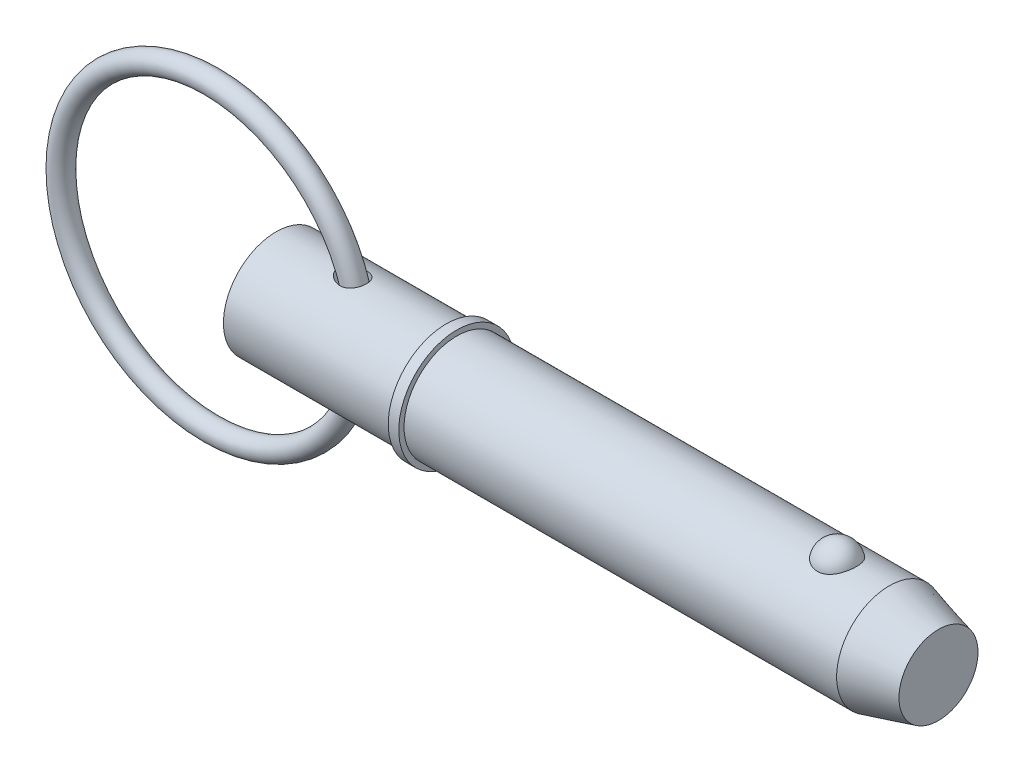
ISO-10303-21;
HEADER;
FILE_DESCRIPTION(('STEP AP214'),'2;1');
FILE_NAME('part.step','',(''),(''),'','','');
FILE_SCHEMA(('AUTOMOTIVE_DESIGN { 1 0 10303 214 1 1 1 1 }'));
ENDSEC;
DATA;
#1=APPLICATION_CONTEXT('core data for automotive mechanical design processes');
#2=APPLICATION_PROTOCOL_DEFINITION('international standard','automotive_design',2000,#1);
#3=PRODUCT_CONTEXT('',#1,'mechanical');
#4=PRODUCT('Part','Part','',(#3));
#5=PRODUCT_RELATED_PRODUCT_CATEGORY('part','',(#4));
#6=PRODUCT_DEFINITION_FORMATION('','',#4);
#7=PRODUCT_DEFINITION_CONTEXT('part definition',#1,'design');
#8=PRODUCT_DEFINITION('design','',#6,#7);
#9=PRODUCT_DEFINITION_SHAPE('','',#8);
#10=(LENGTH_UNIT() NAMED_UNIT(*) SI_UNIT(.MILLI.,.METRE.));
#11=(NAMED_UNIT(*) PLANE_ANGLE_UNIT() SI_UNIT($,.RADIAN.));
#12=(NAMED_UNIT(*) SI_UNIT($,.STERADIAN.) SOLID_ANGLE_UNIT());
#13=UNCERTAINTY_MEASURE_WITH_UNIT(LENGTH_MEASURE(1.E-05),#10,'distance_accuracy_value','');
#14=(GEOMETRIC_REPRESENTATION_CONTEXT(3) GLOBAL_UNCERTAINTY_ASSIGNED_CONTEXT((#13)) GLOBAL_UNIT_ASSIGNED_CONTEXT((#10,
#11,#12)) REPRESENTATION_CONTEXT('',''));
#15=CARTESIAN_POINT('',(0.,0.,0.));
#16=DIRECTION('',(0.,0.,1.));
#17=DIRECTION('',(1.,0.,0.));
#18=AXIS2_PLACEMENT_3D('',#15,#16,#17);
#19=CARTESIAN_POINT('',(-13.640845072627,0.,0.));
#20=DIRECTION('',(0.,0.,1.));
#21=DIRECTION('',(1.,0.,0.));
#22=AXIS2_PLACEMENT_3D('',#19,#20,#21);
#23=TOROIDAL_SURFACE('',#22,31.75,2.223);
#24=CARTESIAN_POINT('',(20.332154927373,0.,0.));
#25=VERTEX_POINT('',#24);
#26=VERTEX_LOOP('',#25);
#27=FACE_BOUND('',#26,.T.);
#28=ADVANCED_FACE('P0_F12',(#27),#23,.T.);
#29=CLOSED_SHELL('',(#28));
#30=MANIFOLD_SOLID_BREP('P0_B1',#29);
#31=CARTESIAN_POINT('',(0.,0.,0.));
#32=DIRECTION('',(1.,0.,0.));
#33=DIRECTION('',(0.,0.,-1.));
#34=AXIS2_PLACEMENT_3D('',#31,#32,#33);
#35=CYLINDRICAL_SURFACE('',#34,11.115);
#36=CARTESIAN_POINT('',(13.5245830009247,11.0328953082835,-1.34849772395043));
#37=CARTESIAN_POINT('',(13.6190616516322,11.0150940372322,-1.49413162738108));
#38=CARTESIAN_POINT('',(13.7272589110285,10.9954577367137,-1.63076546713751));
#39=CARTESIAN_POINT('',(13.9654537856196,10.9550099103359,-1.8834727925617));
#40=CARTESIAN_POINT('',(14.0954990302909,10.9341958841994,-1.99950019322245));
#41=CARTESIAN_POINT('',(14.3718600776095,10.893854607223,-2.20871939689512));
#42=CARTESIAN_POINT('',(14.5180879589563,10.8743212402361,-2.30202655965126));
#43=CARTESIAN_POINT('',(14.8233821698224,10.8385071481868,-2.46515115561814));
#44=CARTESIAN_POINT('',(14.9824448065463,10.8222254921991,-2.53497531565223));
#45=CARTESIAN_POINT('',(15.3233581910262,10.7936101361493,-2.65430007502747));
#46=CARTESIAN_POINT('',(15.5060064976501,10.7817126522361,-2.7016502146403));
#47=CARTESIAN_POINT('',(15.8771124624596,10.7657570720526,-2.76455948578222));
#48=CARTESIAN_POINT('',(16.0655695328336,10.7616981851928,-2.78012182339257));
#49=CARTESIAN_POINT('',(16.4345152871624,10.7624400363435,-2.77724928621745));
#50=CARTESIAN_POINT('',(16.6150121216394,10.7668823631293,-2.76018977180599));
#51=CARTESIAN_POINT('',(16.9695132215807,10.7837407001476,-2.69357457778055));
#52=CARTESIAN_POINT('',(17.1435222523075,10.7961507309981,-2.64404326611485));
#53=CARTESIAN_POINT('',(17.4621418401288,10.8258984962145,-2.51928348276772));
#54=CARTESIAN_POINT('',(17.6079677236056,10.8426430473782,-2.44700611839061));
#55=CARTESIAN_POINT('',(17.884162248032,10.8794194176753,-2.27791740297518));
#56=CARTESIAN_POINT('',(18.0145349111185,10.8994503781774,-2.18111245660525));
#57=CARTESIAN_POINT('',(18.2494965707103,10.9392822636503,-1.9713196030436));
#58=CARTESIAN_POINT('',(18.3550661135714,10.9590421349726,-1.85941863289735));
#59=CARTESIAN_POINT('',(18.5458147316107,10.9970986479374,-1.61919918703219));
#60=CARTESIAN_POINT('',(18.6309947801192,11.0153953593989,-1.49088149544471));
#61=CARTESIAN_POINT('',(18.7786686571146,11.0484675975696,-1.2218388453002));
#62=CARTESIAN_POINT('',(18.8412214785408,11.063252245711,-1.08114735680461));
#63=CARTESIAN_POINT('',(18.9425265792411,11.0877718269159,-0.791025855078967));
#64=CARTESIAN_POINT('',(18.9812780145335,11.0975065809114,-0.641595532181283));
#65=CARTESIAN_POINT('',(19.0343305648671,11.1109435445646,-0.336997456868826));
#66=CARTESIAN_POINT('',(19.0484404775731,11.1145985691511,-0.181794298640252));
#67=CARTESIAN_POINT('',(19.0513147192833,11.1153384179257,0.128864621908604));
#68=CARTESIAN_POINT('',(19.0400783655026,11.112423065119,0.284320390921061));
#69=CARTESIAN_POINT('',(18.9924362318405,11.1003163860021,0.591525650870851));
#70=CARTESIAN_POINT('',(18.9559600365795,11.0911075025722,0.743263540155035));
#71=CARTESIAN_POINT('',(18.858576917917,11.0673920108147,1.0382524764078));
#72=CARTESIAN_POINT('',(18.7976699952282,11.0528854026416,1.18150352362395));
#73=CARTESIAN_POINT('',(18.6529960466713,11.020201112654,1.45511394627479));
#74=CARTESIAN_POINT('',(18.5692772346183,11.0020311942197,1.58549973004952));
#75=CARTESIAN_POINT('',(18.3810003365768,10.9640237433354,1.82995492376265));
#76=CARTESIAN_POINT('',(18.2764441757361,10.9441863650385,1.94402583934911));
#77=CARTESIAN_POINT('',(18.0501398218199,10.9052267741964,2.15183128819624));
#78=CARTESIAN_POINT('',(17.9285270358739,10.8861003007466,2.24571250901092));
#79=CARTESIAN_POINT('',(17.6709592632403,10.8505244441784,2.41175942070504));
#80=CARTESIAN_POINT('',(17.5350055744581,10.8340748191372,2.48392707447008));
#81=CARTESIAN_POINT('',(17.2528390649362,10.8056099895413,2.60497667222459));
#82=CARTESIAN_POINT('',(17.1066353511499,10.7935909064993,2.65387899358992));
#83=CARTESIAN_POINT('',(16.8080326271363,10.7750969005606,2.72799859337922));
#84=CARTESIAN_POINT('',(16.6556326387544,10.7686228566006,2.75321211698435));
#85=CARTESIAN_POINT('',(16.3428877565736,10.761517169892,2.78086153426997));
#86=CARTESIAN_POINT('',(16.1824599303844,10.7611149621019,2.78240297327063));
#87=CARTESIAN_POINT('',(15.863296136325,10.766478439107,2.76156874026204));
#88=CARTESIAN_POINT('',(15.7045607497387,10.7722461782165,2.73918510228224));
#89=CARTESIAN_POINT('',(15.3787211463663,10.7898500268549,2.66904167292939));
#90=CARTESIAN_POINT('',(15.2120794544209,10.8021675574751,2.61925575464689));
#91=CARTESIAN_POINT('',(14.8886284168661,10.8315482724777,2.49496357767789));
#92=CARTESIAN_POINT('',(14.731827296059,10.8486153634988,2.42043695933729));
#93=CARTESIAN_POINT('',(14.4198762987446,10.8870804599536,2.24137362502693));
#94=CARTESIAN_POINT('',(14.2658484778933,10.9087148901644,2.13492229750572));
#95=CARTESIAN_POINT('',(13.9788214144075,10.9526299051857,1.89676517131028));
#96=CARTESIAN_POINT('',(13.8458041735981,10.9749099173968,1.76508120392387));
#97=CARTESIAN_POINT('',(13.6310853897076,11.012885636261,1.50762337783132));
#98=CARTESIAN_POINT('',(13.5444453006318,11.0290026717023,1.38602082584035));
#99=CARTESIAN_POINT('',(13.392158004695,11.0581740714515,1.12983363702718));
#100=CARTESIAN_POINT('',(13.3264946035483,11.0712307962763,0.995259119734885));
#101=CARTESIAN_POINT('',(13.2464179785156,11.0874250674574,0.785640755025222));
#102=CARTESIAN_POINT('',(13.2227369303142,11.0922707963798,0.714166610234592));
#103=CARTESIAN_POINT('',(13.1820656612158,11.1006486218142,0.569277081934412));
#104=CARTESIAN_POINT('',(13.1650721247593,11.1041813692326,0.495862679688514));
#105=CARTESIAN_POINT('',(13.1381118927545,11.1098070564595,0.347711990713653));
#106=CARTESIAN_POINT('',(13.1281436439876,11.1119003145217,0.272975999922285));
#107=CARTESIAN_POINT('',(13.1154243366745,11.1145746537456,0.122890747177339));
#108=CARTESIAN_POINT('',(13.1126723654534,11.1151559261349,0.0475415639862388));
#109=CARTESIAN_POINT('',(13.115160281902,11.1146296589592,-0.160384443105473));
#110=CARTESIAN_POINT('',(13.128061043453,11.111903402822,-0.292944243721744));
#111=CARTESIAN_POINT('',(13.175691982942,11.1019662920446,-0.553751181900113));
#112=CARTESIAN_POINT('',(13.2104121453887,11.094757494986,-0.682000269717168));
#113=CARTESIAN_POINT('',(13.2891255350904,11.0787645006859,-0.901873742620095));
#114=CARTESIAN_POINT('',(13.3290466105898,11.0707438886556,-0.995044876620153));
#115=CARTESIAN_POINT('',(13.4192915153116,11.0529876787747,-1.17599209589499));
#116=CARTESIAN_POINT('',(13.4696154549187,11.0432520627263,-1.26376812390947));
#117=CARTESIAN_POINT('',(13.5245830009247,11.0328953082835,-1.34849772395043));
#118=B_SPLINE_CURVE_WITH_KNOTS('',3,(#36,#37,#38,#39,#40,#41,#42,#43,#44,#45,#46,#47,#48,#49,
#50,#51,#52,#53,#54,#55,#56,#57,#58,#59,#60,#61,#62,#63,#64,#65,#66,#67,#68,#69,#70,#71,#72,#73,
#74,#75,#76,#77,#78,#79,#80,#81,#82,#83,#84,#85,#86,#87,#88,#89,#90,#91,#92,#93,#94,#95,#96,#97,
#98,#99,#100,#101,#102,#103,#104,#105,#106,#107,#108,#109,#110,#111,#112,#113,#114,#115,#116,
#117),.UNSPECIFIED.,.T.,.F.,(4,2,2,2,2,2,2,2,2,2,2,2,2,2,2,2,2,2,2,2,2,2,2,2,2,2,2,2,2,2,2,2,2,
2,2,2,2,2,2,2,4),(0.,0.52309976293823,1.04735506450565,1.56889024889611,2.09027590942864,
2.65465173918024,3.21897064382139,3.76002078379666,4.30066536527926,4.78898318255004,
5.27717362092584,5.74028268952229,6.20336964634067,6.665240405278,7.12712754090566,
7.59258295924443,8.05805091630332,8.52482272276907,8.99159451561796,9.45738731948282,
9.9231371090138,10.3853792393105,10.8475795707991,11.3093743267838,11.7712422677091,
12.2505208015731,12.7299589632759,13.2508366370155,13.7721440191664,14.334890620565,
14.8971525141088,15.3459336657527,15.7943675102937,16.0204422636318,16.2464047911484,
16.4723173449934,16.6982013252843,17.095711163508,17.4930386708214,17.7973741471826,
18.1017128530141),.UNSPECIFIED.);
#119=CARTESIAN_POINT('',(13.5245830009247,11.0328953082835,-1.34849772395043));
#120=VERTEX_POINT('',#119);
#121=EDGE_CURVE('P1_E42',#120,#120,#118,.T.);
#122=ORIENTED_EDGE('',*,*,#121,.T.);
#123=EDGE_LOOP('',(#122));
#124=FACE_BOUND('',#123,.T.);
#125=CARTESIAN_POINT('',(0.,0.,0.));
#126=DIRECTION('',(1.,0.,0.));
#127=DIRECTION('',(0.,0.,-1.));
#128=AXIS2_PLACEMENT_3D('',#125,#126,#127);
#129=CIRCLE('',#128,11.115);
#130=CARTESIAN_POINT('',(0.,0.,-11.115));
#131=VERTEX_POINT('',#130);
#132=EDGE_CURVE('P1_E9',#131,#131,#129,.T.);
#133=ORIENTED_EDGE('',*,*,#132,.T.);
#134=EDGE_LOOP('',(#133));
#135=FACE_BOUND('',#134,.T.);
#136=CARTESIAN_POINT('',(35.877,0.,0.));
#137=DIRECTION('',(1.,0.,0.));
#138=DIRECTION('',(0.,0.,-1.));
#139=AXIS2_PLACEMENT_3D('',#136,#137,#138);
#140=CIRCLE('',#139,11.115);
#141=CARTESIAN_POINT('',(35.877,0.,-11.115));
#142=VERTEX_POINT('',#141);
#143=EDGE_CURVE('P1_E25',#142,#142,#140,.T.);
#144=ORIENTED_EDGE('',*,*,#143,.F.);
#145=EDGE_LOOP('',(#144));
#146=FACE_BOUND('',#145,.T.);
#147=CARTESIAN_POINT('',(13.5245830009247,-11.0328953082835,-1.34849772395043));
#148=CARTESIAN_POINT('',(13.449887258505,-11.0469690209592,-1.233356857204));
#149=CARTESIAN_POINT('',(13.3837464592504,-11.0598986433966,-1.11255897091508));
#150=CARTESIAN_POINT('',(13.271526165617,-11.0822620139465,-0.861680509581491));
#151=CARTESIAN_POINT('',(13.2254273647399,-11.0916991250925,-0.731609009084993));
#152=CARTESIAN_POINT('',(13.1557497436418,-11.1060943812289,-0.464578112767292));
#153=CARTESIAN_POINT('',(13.1322820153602,-11.111030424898,-0.327588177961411));
#154=CARTESIAN_POINT('',(13.1098958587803,-11.1157368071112,-0.0515139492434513));
#155=CARTESIAN_POINT('',(13.1109730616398,-11.1155080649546,0.0875699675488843));
#156=CARTESIAN_POINT('',(13.1367722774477,-11.110088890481,0.354927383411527));
#157=CARTESIAN_POINT('',(13.160070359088,-11.1051972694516,0.483348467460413));
#158=CARTESIAN_POINT('',(13.2268311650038,-11.091413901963,0.734581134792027));
#159=CARTESIAN_POINT('',(13.2702981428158,-11.0825213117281,0.857391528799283));
#160=CARTESIAN_POINT('',(13.3769008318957,-11.0612491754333,1.09871322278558));
#161=CARTESIAN_POINT('',(13.4406446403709,-11.048763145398,1.21694419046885));
#162=CARTESIAN_POINT('',(13.5844860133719,-11.0215642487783,1.44267020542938));
#163=CARTESIAN_POINT('',(13.6645903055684,-11.0068504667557,1.55016080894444));
#164=CARTESIAN_POINT('',(13.8511803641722,-10.9741237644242,1.76795565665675));
#165=CARTESIAN_POINT('',(13.959808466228,-10.9559422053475,1.87639683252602));
#166=CARTESIAN_POINT('',(14.1916437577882,-10.9197998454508,2.07642617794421));
#167=CARTESIAN_POINT('',(14.3148607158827,-10.901839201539,2.16800294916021));
#168=CARTESIAN_POINT('',(14.5931107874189,-10.8649902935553,2.34622033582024));
#169=CARTESIAN_POINT('',(14.7501095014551,-10.8463937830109,2.42986679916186));
#170=CARTESIAN_POINT('',(15.0757118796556,-10.8136392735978,2.57171975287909));
#171=CARTESIAN_POINT('',(15.2443214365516,-10.7994835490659,2.62991321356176));
#172=CARTESIAN_POINT('',(15.599068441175,-10.7767894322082,2.72147498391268));
#173=CARTESIAN_POINT('',(15.7856559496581,-10.768622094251,2.75321798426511));
#174=CARTESIAN_POINT('',(16.1617095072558,-10.7608206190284,2.78356776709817));
#175=CARTESIAN_POINT('',(16.3511739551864,-10.7611818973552,2.78219235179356));
#176=CARTESIAN_POINT('',(16.7138126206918,-10.7705428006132,2.7457129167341));
#177=CARTESIAN_POINT('',(16.8872269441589,-10.7789612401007,2.71287798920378));
#178=CARTESIAN_POINT('',(17.2247245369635,-10.8028011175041,2.61632772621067));
#179=CARTESIAN_POINT('',(17.3888134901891,-10.8182182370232,2.55263143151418));
#180=CARTESIAN_POINT('',(17.6871641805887,-10.8524191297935,2.40281428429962));
#181=CARTESIAN_POINT('',(17.8227812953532,-10.8707652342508,2.31928155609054));
#182=CARTESIAN_POINT('',(18.0770765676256,-10.9094513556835,2.12988301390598));
#183=CARTESIAN_POINT('',(18.1957578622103,-10.9297910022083,2.0240213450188));
#184=CARTESIAN_POINT('',(18.4088055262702,-10.9693230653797,1.79719870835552));
#185=CARTESIAN_POINT('',(18.5038890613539,-10.9885305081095,1.67691225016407));
#186=CARTESIAN_POINT('',(18.6726701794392,-11.0244347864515,1.42183894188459));
#187=CARTESIAN_POINT('',(18.7463681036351,-11.0411316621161,1.28705232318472));
#188=CARTESIAN_POINT('',(18.8708297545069,-11.0702507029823,1.00634471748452));
#189=CARTESIAN_POINT('',(18.9215212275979,-11.0826593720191,0.860390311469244));
#190=CARTESIAN_POINT('',(18.9984973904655,-11.1017993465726,0.561823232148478));
#191=CARTESIAN_POINT('',(19.0247811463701,-11.1085304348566,0.409210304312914));
#192=CARTESIAN_POINT('',(19.0524622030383,-11.1156244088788,0.100537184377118));
#193=CARTESIAN_POINT('',(19.0536873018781,-11.1159432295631,-0.0555394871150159));
#194=CARTESIAN_POINT('',(19.0307837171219,-11.110065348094,-0.365700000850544));
#195=CARTESIAN_POINT('',(19.0066544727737,-11.1038685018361,-0.519783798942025));
#196=CARTESIAN_POINT('',(18.9335163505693,-11.0856111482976,-0.821817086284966));
#197=CARTESIAN_POINT('',(18.88447016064,-11.0735418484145,-0.969757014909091));
#198=CARTESIAN_POINT('',(18.7625929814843,-11.0448501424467,-1.25502066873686));
#199=CARTESIAN_POINT('',(18.6897623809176,-11.0282278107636,-1.39234456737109));
#200=CARTESIAN_POINT('',(18.522359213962,-10.9923333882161,-1.65195905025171));
#201=CARTESIAN_POINT('',(18.427863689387,-10.9730707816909,-1.77430060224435));
#202=CARTESIAN_POINT('',(18.2194216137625,-10.9340072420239,-2.00099176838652));
#203=CARTESIAN_POINT('',(18.1054772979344,-10.9142063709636,-2.10534344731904));
#204=CARTESIAN_POINT('',(17.8622613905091,-10.8764452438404,-2.2924289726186));
#205=CARTESIAN_POINT('',(17.7331196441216,-10.8584715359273,-2.3753290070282));
#206=CARTESIAN_POINT('',(17.4625069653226,-10.8261386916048,-2.51860389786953));
#207=CARTESIAN_POINT('',(17.3210365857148,-10.8117793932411,-2.57897976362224));
#208=CARTESIAN_POINT('',(17.0290309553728,-10.7880576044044,-2.67648805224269));
#209=CARTESIAN_POINT('',(16.8784484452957,-10.7787241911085,-2.71348542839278));
#210=CARTESIAN_POINT('',(16.573148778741,-10.7659618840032,-2.7636855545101));
#211=CARTESIAN_POINT('',(16.4184306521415,-10.7625343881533,-2.77688267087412));
#212=CARTESIAN_POINT('',(16.1008073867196,-10.761643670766,-2.78033419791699));
#213=CARTESIAN_POINT('',(15.9378898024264,-10.7644957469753,-2.76937572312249));
#214=CARTESIAN_POINT('',(15.6157286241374,-10.7762062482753,-2.72344300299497));
#215=CARTESIAN_POINT('',(15.4564861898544,-10.7850665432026,-2.68846128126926));
#216=CARTESIAN_POINT('',(15.1305734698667,-10.808737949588,-2.59174021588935));
#217=CARTESIAN_POINT('',(14.9645834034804,-10.8240246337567,-2.52782071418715));
#218=CARTESIAN_POINT('',(14.6448218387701,-10.8585969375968,-2.37491543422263));
#219=CARTESIAN_POINT('',(14.4910653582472,-10.8778873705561,-2.28589943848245));
#220=CARTESIAN_POINT('',(14.1837929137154,-10.920550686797,-2.07312951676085));
#221=CARTESIAN_POINT('',(14.0321999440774,-10.9441390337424,-1.94661563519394));
#222=CARTESIAN_POINT('',(13.756115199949,-10.9902311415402,-1.66673537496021));
#223=CARTESIAN_POINT('',(13.6315733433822,-11.0127368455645,-1.51341958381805));
#224=CARTESIAN_POINT('',(13.5245830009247,-11.0328953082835,-1.34849772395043));
#225=B_SPLINE_CURVE_WITH_KNOTS('',3,(#147,#148,#149,#150,#151,#152,#153,#154,#155,#156,#157,
#158,#159,#160,#161,#162,#163,#164,#165,#166,#167,#168,#169,#170,#171,#172,#173,#174,#175,#176,
#177,#178,#179,#180,#181,#182,#183,#184,#185,#186,#187,#188,#189,#190,#191,#192,#193,#194,#195,
#196,#197,#198,#199,#200,#201,#202,#203,#204,#205,#206,#207,#208,#209,#210,#211,#212,#213,#214,
#215,#216,#217,#218,#219,#220,#221,#222,#223,#224),.UNSPECIFIED.,.T.,.F.,(4,2,2,2,2,2,2,2,2,2,2,
2,2,2,2,2,2,2,2,2,2,2,2,2,2,2,2,2,2,2,2,2,2,2,2,2,2,2,4),(0.,0.4133945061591,0.8263899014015,
1.24140245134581,1.65634113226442,2.04635967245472,2.43646050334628,2.83958259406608,
3.24287078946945,3.70479277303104,4.16702582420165,4.70130512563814,5.23585761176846,
5.80123945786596,6.36631739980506,6.89348344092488,7.42032464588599,7.8989135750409,
8.37741373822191,8.83881993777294,9.30021877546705,9.76305681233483,10.2259125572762,
10.6919479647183,11.1579936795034,11.6247393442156,12.0914773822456,12.55658073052,
13.0216306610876,13.4829619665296,13.9442725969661,14.408224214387,14.8722856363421,
15.3601762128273,15.8482186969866,16.3815107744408,16.9154477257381,17.5086806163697,
18.1008056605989),.UNSPECIFIED.);
#226=CARTESIAN_POINT('',(13.5245830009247,-11.0328953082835,-1.34849772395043));
#227=VERTEX_POINT('',#226);
#228=EDGE_CURVE('P1_E17',#227,#227,#225,.T.);
#229=ORIENTED_EDGE('',*,*,#228,.T.);
#230=EDGE_LOOP('',(#229));
#231=FACE_BOUND('',#230,.T.);
#232=ADVANCED_FACE('P1_F13',(#124,#135,#146,#231),#35,.T.);
#233=CARTESIAN_POINT('',(0.,0.,0.));
#234=DIRECTION('',(1.,0.,0.));
#235=DIRECTION('',(0.,0.,-1.));
#236=AXIS2_PLACEMENT_3D('',#233,#234,#235);
#237=CYLINDRICAL_SURFACE('',#236,11.115);
#238=CARTESIAN_POINT('',(129.329563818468,0.,0.));
#239=DIRECTION('',(1.,0.,0.));
#240=DIRECTION('',(0.,0.,-1.));
#241=AXIS2_PLACEMENT_3D('',#238,#239,#240);
#242=CIRCLE('',#241,11.115);
#243=CARTESIAN_POINT('',(129.329563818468,0.,-11.115));
#244=VERTEX_POINT('',#243);
#245=EDGE_CURVE('P1_E99',#244,#244,#242,.T.);
#246=ORIENTED_EDGE('',*,*,#245,.F.);
#247=EDGE_LOOP('',(#246));
#248=FACE_BOUND('',#247,.T.);
#249=CARTESIAN_POINT('',(38.1,0.,0.));
#250=DIRECTION('',(1.,0.,0.));
#251=DIRECTION('',(0.,0.,-1.));
#252=AXIS2_PLACEMENT_3D('',#249,#250,#251);
#253=CIRCLE('',#252,11.115);
#254=CARTESIAN_POINT('',(38.1,0.,-11.115));
#255=VERTEX_POINT('',#254);
#256=EDGE_CURVE('P1_E96',#255,#255,#253,.T.);
#257=ORIENTED_EDGE('',*,*,#256,.T.);
#258=EDGE_LOOP('',(#257));
#259=FACE_BOUND('',#258,.T.);
#260=CARTESIAN_POINT('',(118.331068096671,10.3028087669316,4.17077409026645));
#261=CARTESIAN_POINT('',(118.114775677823,10.3028003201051,4.17078240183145));
#262=CARTESIAN_POINT('',(117.898548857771,10.3098895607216,4.15340593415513));
#263=CARTESIAN_POINT('',(117.472540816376,10.3373834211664,4.08449540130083));
#264=CARTESIAN_POINT('',(117.262757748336,10.3577841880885,4.0329712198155));
#265=CARTESIAN_POINT('',(116.855782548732,10.4095237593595,3.89746513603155));
#266=CARTESIAN_POINT('',(116.658572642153,10.4408466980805,3.81353029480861));
#267=CARTESIAN_POINT('',(116.281338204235,10.5110236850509,3.61560339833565));
#268=CARTESIAN_POINT('',(116.101317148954,10.5498792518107,3.50160528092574));
#269=CARTESIAN_POINT('',(115.757684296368,10.6322884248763,3.24292464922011));
#270=CARTESIAN_POINT('',(115.594686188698,10.6759443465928,3.09746040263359));
#271=CARTESIAN_POINT('',(115.294591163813,10.7625291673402,2.78171925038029));
#272=CARTESIAN_POINT('',(115.157499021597,10.8054579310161,2.61143778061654));
#273=CARTESIAN_POINT('',(114.906408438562,10.8881935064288,2.24226695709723));
#274=CARTESIAN_POINT('',(114.793710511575,10.9277761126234,2.04244123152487));
#275=CARTESIAN_POINT('',(114.601777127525,10.997484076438,1.62578254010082));
#276=CARTESIAN_POINT('',(114.522544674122,11.0276085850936,1.40894804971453));
#277=CARTESIAN_POINT('',(114.398303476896,11.0756732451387,0.961250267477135));
#278=CARTESIAN_POINT('',(114.353760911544,11.0934470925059,0.730239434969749));
#279=CARTESIAN_POINT('',(114.301569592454,11.1143331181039,0.263439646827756));
#280=CARTESIAN_POINT('',(114.293920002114,11.1174456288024,0.0276507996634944));
#281=CARTESIAN_POINT('',(114.31561056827,11.1087161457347,-0.440729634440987));
#282=CARTESIAN_POINT('',(114.344762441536,11.0969502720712,-0.673331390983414));
#283=CARTESIAN_POINT('',(114.439143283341,11.0597872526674,-1.12996621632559));
#284=CARTESIAN_POINT('',(114.504372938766,11.0343898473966,-1.35399912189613));
#285=CARTESIAN_POINT('',(114.66969844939,10.972515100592,-1.78750286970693));
#286=CARTESIAN_POINT('',(114.76983863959,10.9360236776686,-1.99695478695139));
#287=CARTESIAN_POINT('',(115.002940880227,10.8557595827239,-2.3952066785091));
#288=CARTESIAN_POINT('',(115.135905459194,10.8119863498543,-2.5840050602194));
#289=CARTESIAN_POINT('',(115.432407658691,10.7216733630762,-2.93635726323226));
#290=CARTESIAN_POINT('',(115.596056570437,10.675123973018,-3.09981510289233));
#291=CARTESIAN_POINT('',(115.949860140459,10.5846571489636,-3.39592247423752));
#292=CARTESIAN_POINT('',(116.140012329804,10.5407394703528,-3.52857487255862));
#293=CARTESIAN_POINT('',(116.53750141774,10.4616690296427,-3.75646057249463));
#294=CARTESIAN_POINT('',(116.74436705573,10.4263443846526,-3.85245432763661));
#295=CARTESIAN_POINT('',(117.172954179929,10.3675574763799,-4.00798747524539));
#296=CARTESIAN_POINT('',(117.394670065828,10.344090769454,-4.0675405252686));
#297=CARTESIAN_POINT('',(117.834669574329,10.3128282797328,-4.14614314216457));
#298=CARTESIAN_POINT('',(118.052565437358,10.3043040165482,-4.1670783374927));
#299=CARTESIAN_POINT('',(118.48894951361,10.3016771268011,-4.17357158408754));
#300=CARTESIAN_POINT('',(118.707437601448,10.3075716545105,-4.15913661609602));
#301=CARTESIAN_POINT('',(119.131744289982,10.3326686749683,-4.09636961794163));
#302=CARTESIAN_POINT('',(119.337745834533,10.3514555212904,-4.0490957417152));
#303=CARTESIAN_POINT('',(119.738576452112,10.399818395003,-3.92320197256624));
#304=CARTESIAN_POINT('',(119.9334046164,10.4293952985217,-3.84457953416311));
#305=CARTESIAN_POINT('',(120.311191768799,10.4969600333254,-3.65612410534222));
#306=CARTESIAN_POINT('',(120.493797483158,10.5351178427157,-3.54564545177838));
#307=CARTESIAN_POINT('',(120.838204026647,10.6154999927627,-3.29718036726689));
#308=CARTESIAN_POINT('',(121.000000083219,10.657725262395,-3.15918764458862));
#309=CARTESIAN_POINT('',(121.306959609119,10.744212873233,-2.85163580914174));
#310=CARTESIAN_POINT('',(121.450891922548,10.7884718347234,-2.68084605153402));
#311=CARTESIAN_POINT('',(121.709237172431,10.872374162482,-2.3172186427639));
#312=CARTESIAN_POINT('',(121.823644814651,10.9120167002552,-2.12437704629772));
#313=CARTESIAN_POINT('',(122.023873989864,10.9838919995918,-1.71516999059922));
#314=CARTESIAN_POINT('',(122.10866178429,11.0158465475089,-1.498248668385));
#315=CARTESIAN_POINT('',(122.24268382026,11.0673523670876,-1.052285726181));
#316=CARTESIAN_POINT('',(122.291917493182,11.086903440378,-0.823243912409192));
#317=CARTESIAN_POINT('',(122.353891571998,11.1116323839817,-0.359087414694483));
#318=CARTESIAN_POINT('',(122.366566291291,11.1167843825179,-0.123962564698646));
#319=CARTESIAN_POINT('',(122.354973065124,11.1121144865,0.345220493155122));
#320=CARTESIAN_POINT('',(122.330705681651,11.1022928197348,0.579278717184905));
#321=CARTESIAN_POINT('',(122.245907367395,11.0687504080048,1.03866534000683));
#322=CARTESIAN_POINT('',(122.185529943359,11.0450885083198,1.26402641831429));
#323=CARTESIAN_POINT('',(122.029853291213,10.9863185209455,1.70076772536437));
#324=CARTESIAN_POINT('',(121.934551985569,10.9512097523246,1.91214712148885));
#325=CARTESIAN_POINT('',(121.710397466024,10.8729733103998,2.31608359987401));
#326=CARTESIAN_POINT('',(121.581380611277,10.8298068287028,2.50854240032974));
#327=CARTESIAN_POINT('',(121.292732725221,10.7401896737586,2.86808766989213));
#328=CARTESIAN_POINT('',(121.133102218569,10.6937390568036,3.03517457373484));
#329=CARTESIAN_POINT('',(120.787534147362,10.6029321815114,3.33857581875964));
#330=CARTESIAN_POINT('',(120.601708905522,10.5585680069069,3.47501541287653));
#331=CARTESIAN_POINT('',(120.207875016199,10.4769321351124,3.71390897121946));
#332=CARTESIAN_POINT('',(119.999863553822,10.439661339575,3.81635861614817));
#333=CARTESIAN_POINT('',(119.554066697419,10.3749407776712,3.98910631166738));
#334=CARTESIAN_POINT('',(119.315234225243,10.3482457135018,4.05700929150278));
#335=CARTESIAN_POINT('',(118.827925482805,10.312188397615,4.14782844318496));
#336=CARTESIAN_POINT('',(118.579453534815,10.3028184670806,4.17076454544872));
#337=CARTESIAN_POINT('',(118.331068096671,10.3028087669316,4.17077409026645));
#338=B_SPLINE_CURVE_WITH_KNOTS('',3,(#260,#261,#262,#263,#264,#265,#266,#267,#268,#269,#270,
#271,#272,#273,#274,#275,#276,#277,#278,#279,#280,#281,#282,#283,#284,#285,#286,#287,#288,#289,
#290,#291,#292,#293,#294,#295,#296,#297,#298,#299,#300,#301,#302,#303,#304,#305,#306,#307,#308,
#309,#310,#311,#312,#313,#314,#315,#316,#317,#318,#319,#320,#321,#322,#323,#324,#325,#326,#327,
#328,#329,#330,#331,#332,#333,#334,#335,#336,#337),.UNSPECIFIED.,.T.,.F.,(4,2,2,2,2,2,2,2,2,2,2,
2,2,2,2,2,2,2,2,2,2,2,2,2,2,2,2,2,2,2,2,2,2,2,2,2,2,2,4),(0.,0.647966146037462,1.29574482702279,
1.94258643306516,2.58955857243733,3.25496465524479,3.92049326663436,4.61566368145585,
5.3108964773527,6.01531821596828,6.71972398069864,7.42054043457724,8.12137023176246,
8.82309331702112,9.52487047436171,10.2292439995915,10.9335519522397,11.6223330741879,
12.3108558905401,12.9647664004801,13.6185478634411,14.2521847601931,14.8858731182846,
15.5334360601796,16.1811472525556,16.8611459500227,17.5412664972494,18.2431855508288,
18.9451158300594,19.6483065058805,20.3514864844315,21.0516982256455,21.7519516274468,
22.4556690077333,23.1593743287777,23.8601491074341,24.5610129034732,25.3054529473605,
26.049562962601),.UNSPECIFIED.);
#339=CARTESIAN_POINT('',(118.331068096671,10.3028087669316,4.17077409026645));
#340=VERTEX_POINT('',#339);
#341=EDGE_CURVE('P1_E34',#340,#340,#338,.T.);
#342=ORIENTED_EDGE('',*,*,#341,.T.);
#343=EDGE_LOOP('',(#342));
#344=FACE_BOUND('',#343,.T.);
#345=ADVANCED_FACE('P1_F46',(#248,#259,#344),#237,.T.);
#346=CARTESIAN_POINT('',(0.,0.,0.));
#347=DIRECTION('',(-1.,0.,0.));
#348=DIRECTION('',(0.,0.,1.));
#349=AXIS2_PLACEMENT_3D('',#346,#347,#348);
#350=PLANE('',#349);
#351=ORIENTED_EDGE('',*,*,#132,.F.);
#352=EDGE_LOOP('',(#351));
#353=FACE_BOUND('',#352,.T.);
#354=ADVANCED_FACE('P1_F15',(#353),#350,.T.);
#355=CARTESIAN_POINT('',(35.877,11.115,0.));
#356=DIRECTION('',(-1.,0.,0.));
#357=DIRECTION('',(0.,0.,1.));
#358=AXIS2_PLACEMENT_3D('',#355,#356,#357);
#359=PLANE('',#358);
#360=ORIENTED_EDGE('',*,*,#143,.T.);
#361=EDGE_LOOP('',(#360));
#362=FACE_BOUND('',#361,.T.);
#363=CARTESIAN_POINT('',(35.877,0.,0.));
#364=DIRECTION('',(1.,0.,0.));
#365=DIRECTION('',(0.,0.,-1.));
#366=AXIS2_PLACEMENT_3D('',#363,#364,#365);
#367=CIRCLE('',#366,12.2265);
#368=CARTESIAN_POINT('',(35.877,0.,-12.2265));
#369=VERTEX_POINT('',#368);
#370=EDGE_CURVE('P1_E30',#369,#369,#367,.T.);
#371=ORIENTED_EDGE('',*,*,#370,.F.);
#372=EDGE_LOOP('',(#371));
#373=FACE_BOUND('',#372,.T.);
#374=ADVANCED_FACE('P1_F81',(#362,#373),#359,.T.);
#375=CARTESIAN_POINT('',(0.,0.,0.));
#376=DIRECTION('',(1.,0.,0.));
#377=DIRECTION('',(0.,0.,-1.));
#378=AXIS2_PLACEMENT_3D('',#375,#376,#377);
#379=CYLINDRICAL_SURFACE('',#378,12.2265);
#380=ORIENTED_EDGE('',*,*,#370,.T.);
#381=EDGE_LOOP('',(#380));
#382=FACE_BOUND('',#381,.T.);
#383=CARTESIAN_POINT('',(38.1,0.,0.));
#384=DIRECTION('',(1.,0.,0.));
#385=DIRECTION('',(0.,0.,-1.));
#386=AXIS2_PLACEMENT_3D('',#383,#384,#385);
#387=CIRCLE('',#386,12.2265);
#388=CARTESIAN_POINT('',(38.1,0.,-12.2265));
#389=VERTEX_POINT('',#388);
#390=EDGE_CURVE('P1_E95',#389,#389,#387,.T.);
#391=ORIENTED_EDGE('',*,*,#390,.F.);
#392=EDGE_LOOP('',(#391));
#393=FACE_BOUND('',#392,.T.);
#394=ADVANCED_FACE('P1_F68',(#382,#393),#379,.T.);
#395=CARTESIAN_POINT('',(38.1,12.2265,0.));
#396=DIRECTION('',(1.,0.,0.));
#397=DIRECTION('',(0.,0.,-1.));
#398=AXIS2_PLACEMENT_3D('',#395,#396,#397);
#399=PLANE('',#398);
#400=ORIENTED_EDGE('',*,*,#390,.T.);
#401=EDGE_LOOP('',(#400));
#402=FACE_BOUND('',#401,.T.);
#403=ORIENTED_EDGE('',*,*,#256,.F.);
#404=EDGE_LOOP('',(#403));
#405=FACE_BOUND('',#404,.T.);
#406=ADVANCED_FACE('P1_F62',(#402,#405),#399,.T.);
#407=CARTESIAN_POINT('',(139.7,0.,0.));
#408=DIRECTION('',(-1.,0.,0.));
#409=DIRECTION('',(0.,0.,1.));
#410=AXIS2_PLACEMENT_3D('',#407,#408,#409);
#411=CONICAL_SURFACE('',#410,8.33625000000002,0.26179938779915);
#412=ORIENTED_EDGE('',*,*,#245,.T.);
#413=EDGE_LOOP('',(#412));
#414=FACE_BOUND('',#413,.T.);
#415=CARTESIAN_POINT('',(139.7,0.,0.));
#416=DIRECTION('',(1.,0.,0.));
#417=DIRECTION('',(0.,0.,-1.));
#418=AXIS2_PLACEMENT_3D('',#415,#416,#417);
#419=CIRCLE('',#418,8.33625000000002);
#420=CARTESIAN_POINT('',(139.7,0.,-8.33625000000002));
#421=VERTEX_POINT('',#420);
#422=EDGE_CURVE('P1_E41',#421,#421,#419,.T.);
#423=ORIENTED_EDGE('',*,*,#422,.F.);
#424=EDGE_LOOP('',(#423));
#425=FACE_BOUND('',#424,.T.);
#426=ADVANCED_FACE('P1_F59',(#414,#425),#411,.T.);
#427=CARTESIAN_POINT('',(139.7,8.33625000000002,0.));
#428=DIRECTION('',(1.,0.,0.));
#429=DIRECTION('',(0.,0.,-1.));
#430=AXIS2_PLACEMENT_3D('',#427,#428,#429);
#431=PLANE('',#430);
#432=ORIENTED_EDGE('',*,*,#422,.T.);
#433=EDGE_LOOP('',(#432));
#434=FACE_BOUND('',#433,.T.);
#435=ADVANCED_FACE('P1_F55',(#434),#431,.T.);
#436=CARTESIAN_POINT('',(118.331068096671,10.0035,0.));
#437=DIRECTION('',(-1.,0.,0.));
#438=DIRECTION('',(0.,1.,0.));
#439=AXIS2_PLACEMENT_3D('',#436,#437,#438);
#440=SPHERICAL_SURFACE('',#439,4.18150000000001);
#441=ORIENTED_EDGE('',*,*,#341,.F.);
#442=EDGE_LOOP('',(#441));
#443=FACE_BOUND('',#442,.T.);
#444=ADVANCED_FACE('P1_F50',(#443),#440,.T.);
#445=CARTESIAN_POINT('',(-13.640845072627,0.,0.));
#446=DIRECTION('',(0.,0.,1.));
#447=DIRECTION('',(1.,0.,0.));
#448=AXIS2_PLACEMENT_3D('',#445,#446,#447);
#449=TOROIDAL_SURFACE('',#448,31.75,2.77875);
#450=ORIENTED_EDGE('',*,*,#228,.F.);
#451=EDGE_LOOP('',(#450));
#452=FACE_BOUND('',#451,.T.);
#453=ORIENTED_EDGE('',*,*,#121,.F.);
#454=EDGE_LOOP('',(#453));
#455=FACE_BOUND('',#454,.T.);
#456=ADVANCED_FACE('P1_F54',(#452,#455),#449,.F.);
#457=CLOSED_SHELL('',(#232,#345,#354,#374,#394,#406,#426,#435,#444,#456));
#458=MANIFOLD_SOLID_BREP('P1_B1',#457);
#459=ADVANCED_BREP_SHAPE_REPRESENTATION('',(#18,#30,#458),#14);
#460=SHAPE_DEFINITION_REPRESENTATION(#9,#459);
ENDSEC;
END-ISO-10303-21;
